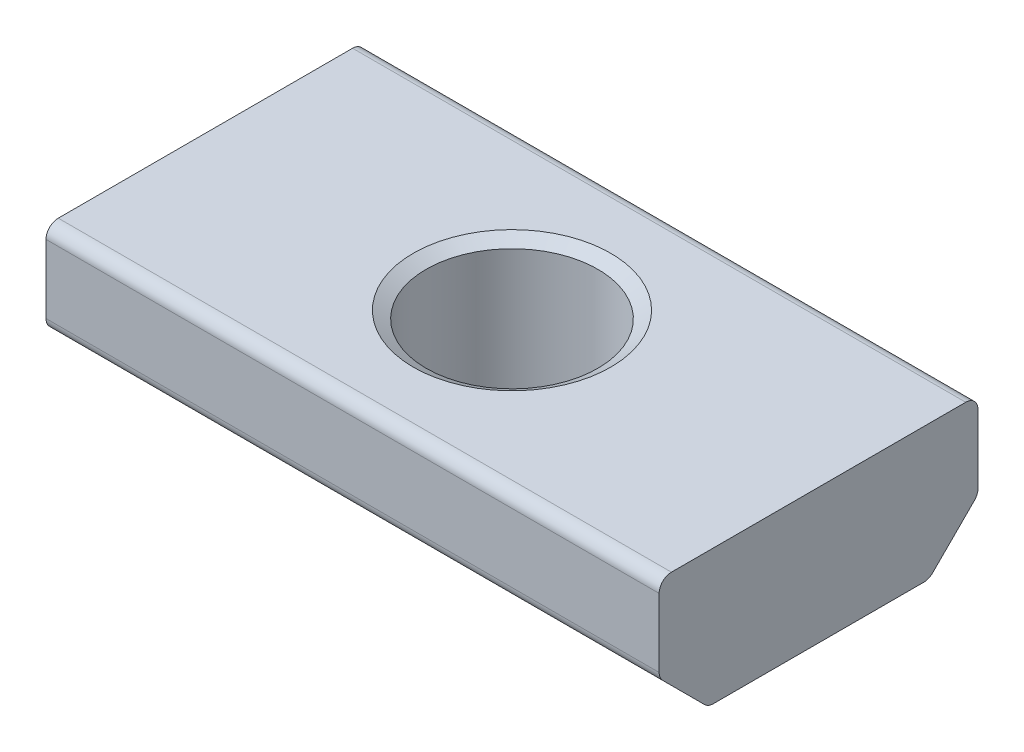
ISO-10303-21;
HEADER;
FILE_DESCRIPTION(('STEP AP214'),'2;1');
FILE_NAME('part.step','',(''),(''),'','','');
FILE_SCHEMA(('AUTOMOTIVE_DESIGN { 1 0 10303 214 1 1 1 1 }'));
ENDSEC;
DATA;
#1=APPLICATION_CONTEXT('core data for automotive mechanical design processes');
#2=APPLICATION_PROTOCOL_DEFINITION('international standard','automotive_design',2000,#1);
#3=PRODUCT_CONTEXT('',#1,'mechanical');
#4=PRODUCT('Part','Part','',(#3));
#5=PRODUCT_RELATED_PRODUCT_CATEGORY('part','',(#4));
#6=PRODUCT_DEFINITION_FORMATION('','',#4);
#7=PRODUCT_DEFINITION_CONTEXT('part definition',#1,'design');
#8=PRODUCT_DEFINITION('design','',#6,#7);
#9=PRODUCT_DEFINITION_SHAPE('','',#8);
#10=(LENGTH_UNIT() NAMED_UNIT(*) SI_UNIT(.MILLI.,.METRE.));
#11=(NAMED_UNIT(*) PLANE_ANGLE_UNIT() SI_UNIT($,.RADIAN.));
#12=(NAMED_UNIT(*) SI_UNIT($,.STERADIAN.) SOLID_ANGLE_UNIT());
#13=UNCERTAINTY_MEASURE_WITH_UNIT(LENGTH_MEASURE(1.E-05),#10,'distance_accuracy_value','');
#14=(GEOMETRIC_REPRESENTATION_CONTEXT(3) GLOBAL_UNCERTAINTY_ASSIGNED_CONTEXT((#13)) GLOBAL_UNIT_ASSIGNED_CONTEXT((#10,
#11,#12)) REPRESENTATION_CONTEXT('',''));
#15=CARTESIAN_POINT('',(0.,0.,0.));
#16=DIRECTION('',(0.,0.,1.));
#17=DIRECTION('',(1.,0.,0.));
#18=AXIS2_PLACEMENT_3D('',#15,#16,#17);
#19=CARTESIAN_POINT('',(0.,5.5,0.));
#20=DIRECTION('',(1.,0.,0.));
#21=DIRECTION('',(0.,0.,-1.));
#22=AXIS2_PLACEMENT_3D('',#19,#20,#21);
#23=PLANE('',#22);
#24=DIRECTION('',(0.,0.707106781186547,0.707106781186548));
#25=VECTOR('',#24,1.);
#26=CARTESIAN_POINT('',(0.,1.99999999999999,0.));
#27=LINE('',#26,#25);
#28=CARTESIAN_POINT('',(0.,0.146446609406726,-1.85355339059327));
#29=VERTEX_POINT('',#28);
#30=CARTESIAN_POINT('',(0.,1.85355339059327,-0.146446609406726));
#31=VERTEX_POINT('',#30);
#32=EDGE_CURVE('E153',#29,#31,#27,.T.);
#33=ORIENTED_EDGE('',*,*,#32,.T.);
#34=CARTESIAN_POINT('',(0.,2.20710678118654,-0.5));
#35=DIRECTION('',(1.,0.,0.));
#36=DIRECTION('',(0.,0.,-1.));
#37=AXIS2_PLACEMENT_3D('',#34,#35,#36);
#38=CIRCLE('',#37,0.5);
#39=CARTESIAN_POINT('',(0.,2.20710678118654,0.));
#40=VERTEX_POINT('',#39);
#41=EDGE_CURVE('E152',#31,#40,#38,.F.);
#42=ORIENTED_EDGE('',*,*,#41,.T.);
#43=DIRECTION('',(0.,-1.,0.));
#44=VECTOR('',#43,1.);
#45=CARTESIAN_POINT('',(0.,5.5,0.));
#46=LINE('',#45,#44);
#47=CARTESIAN_POINT('',(0.,5.,0.));
#48=VERTEX_POINT('',#47);
#49=EDGE_CURVE('E142',#48,#40,#46,.T.);
#50=ORIENTED_EDGE('',*,*,#49,.F.);
#51=CARTESIAN_POINT('',(0.,5.,-0.5));
#52=DIRECTION('',(1.,0.,0.));
#53=DIRECTION('',(0.,0.,-1.));
#54=AXIS2_PLACEMENT_3D('',#51,#52,#53);
#55=CIRCLE('',#54,0.5);
#56=CARTESIAN_POINT('',(0.,5.5,-0.5));
#57=VERTEX_POINT('',#56);
#58=EDGE_CURVE('E62',#48,#57,#55,.F.);
#59=ORIENTED_EDGE('',*,*,#58,.T.);
#60=DIRECTION('',(0.,0.,1.));
#61=VECTOR('',#60,1.);
#62=CARTESIAN_POINT('',(0.,5.5,0.));
#63=LINE('',#62,#61);
#64=CARTESIAN_POINT('',(0.,5.5,-12.5));
#65=VERTEX_POINT('',#64);
#66=EDGE_CURVE('E190',#65,#57,#63,.T.);
#67=ORIENTED_EDGE('',*,*,#66,.F.);
#68=CARTESIAN_POINT('',(0.,5.,-12.5));
#69=DIRECTION('',(1.,0.,0.));
#70=DIRECTION('',(0.,0.,-1.));
#71=AXIS2_PLACEMENT_3D('',#68,#69,#70);
#72=CIRCLE('',#71,0.5);
#73=CARTESIAN_POINT('',(0.,5.,-13.));
#74=VERTEX_POINT('',#73);
#75=EDGE_CURVE('E70',#65,#74,#72,.F.);
#76=ORIENTED_EDGE('',*,*,#75,.T.);
#77=DIRECTION('',(0.,-1.,0.));
#78=VECTOR('',#77,1.);
#79=CARTESIAN_POINT('',(0.,5.5,-13.));
#80=LINE('',#79,#78);
#81=CARTESIAN_POINT('',(0.,2.20710678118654,-13.));
#82=VERTEX_POINT('',#81);
#83=EDGE_CURVE('E197',#74,#82,#80,.T.);
#84=ORIENTED_EDGE('',*,*,#83,.T.);
#85=CARTESIAN_POINT('',(0.,2.20710678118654,-12.5));
#86=DIRECTION('',(1.,0.,0.));
#87=DIRECTION('',(0.,0.,-1.));
#88=AXIS2_PLACEMENT_3D('',#85,#86,#87);
#89=CIRCLE('',#88,0.5);
#90=CARTESIAN_POINT('',(0.,1.85355339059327,-12.8535533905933));
#91=VERTEX_POINT('',#90);
#92=EDGE_CURVE('E159',#82,#91,#89,.F.);
#93=ORIENTED_EDGE('',*,*,#92,.T.);
#94=DIRECTION('',(0.,-0.707106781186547,0.707106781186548));
#95=VECTOR('',#94,1.);
#96=CARTESIAN_POINT('',(0.,1.99999999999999,-13.));
#97=LINE('',#96,#95);
#98=CARTESIAN_POINT('',(0.,0.146446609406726,-11.1464466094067));
#99=VERTEX_POINT('',#98);
#100=EDGE_CURVE('E216',#91,#99,#97,.T.);
#101=ORIENTED_EDGE('',*,*,#100,.T.);
#102=CARTESIAN_POINT('',(0.,0.5,-10.7928932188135));
#103=DIRECTION('',(1.,0.,0.));
#104=DIRECTION('',(0.,0.,-1.));
#105=AXIS2_PLACEMENT_3D('',#102,#103,#104);
#106=CIRCLE('',#105,0.5);
#107=CARTESIAN_POINT('',(0.,0.,-10.7928932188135));
#108=VERTEX_POINT('',#107);
#109=EDGE_CURVE('E166',#99,#108,#106,.F.);
#110=ORIENTED_EDGE('',*,*,#109,.T.);
#111=DIRECTION('',(0.,0.,1.));
#112=VECTOR('',#111,1.);
#113=CARTESIAN_POINT('',(0.,0.,0.));
#114=LINE('',#113,#112);
#115=CARTESIAN_POINT('',(0.,0.,-2.20710678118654));
#116=VERTEX_POINT('',#115);
#117=EDGE_CURVE('E206',#108,#116,#114,.T.);
#118=ORIENTED_EDGE('',*,*,#117,.T.);
#119=CARTESIAN_POINT('',(0.,0.5,-2.20710678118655));
#120=DIRECTION('',(1.,0.,0.));
#121=DIRECTION('',(0.,0.,-1.));
#122=AXIS2_PLACEMENT_3D('',#119,#120,#121);
#123=CIRCLE('',#122,0.5);
#124=EDGE_CURVE('E168',#116,#29,#123,.F.);
#125=ORIENTED_EDGE('',*,*,#124,.T.);
#126=EDGE_LOOP('',(#33,#42,#50,#59,#67,#76,#84,#93,#101,#110,#118,#125));
#127=FACE_BOUND('',#126,.T.);
#128=ADVANCED_FACE('F47',(#127),#23,.F.);
#129=CARTESIAN_POINT('',(0.,5.5,0.));
#130=DIRECTION('',(0.,0.,-1.));
#131=DIRECTION('',(-1.,0.,0.));
#132=AXIS2_PLACEMENT_3D('',#129,#130,#131);
#133=PLANE('',#132);
#134=ORIENTED_EDGE('',*,*,#49,.T.);
#135=DIRECTION('',(1.,0.,0.));
#136=VECTOR('',#135,1.);
#137=CARTESIAN_POINT('',(25.,2.20710678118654,0.));
#138=LINE('',#137,#136);
#139=CARTESIAN_POINT('',(25.,2.20710678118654,0.));
#140=VERTEX_POINT('',#139);
#141=EDGE_CURVE('E147',#40,#140,#138,.T.);
#142=ORIENTED_EDGE('',*,*,#141,.T.);
#143=DIRECTION('',(0.,-1.,0.));
#144=VECTOR('',#143,1.);
#145=CARTESIAN_POINT('',(25.,5.5,0.));
#146=LINE('',#145,#144);
#147=CARTESIAN_POINT('',(25.,5.,0.));
#148=VERTEX_POINT('',#147);
#149=EDGE_CURVE('E145',#148,#140,#146,.T.);
#150=ORIENTED_EDGE('',*,*,#149,.F.);
#151=DIRECTION('',(1.,0.,0.));
#152=VECTOR('',#151,1.);
#153=CARTESIAN_POINT('',(0.,5.,0.));
#154=LINE('',#153,#152);
#155=EDGE_CURVE('E139',#148,#48,#154,.F.);
#156=ORIENTED_EDGE('',*,*,#155,.T.);
#157=EDGE_LOOP('',(#134,#142,#150,#156));
#158=FACE_BOUND('',#157,.T.);
#159=ADVANCED_FACE('F140',(#158),#133,.F.);
#160=CARTESIAN_POINT('',(25.,5.5,0.));
#161=DIRECTION('',(-1.,0.,0.));
#162=DIRECTION('',(0.,0.,1.));
#163=AXIS2_PLACEMENT_3D('',#160,#161,#162);
#164=PLANE('',#163);
#165=ORIENTED_EDGE('',*,*,#149,.T.);
#166=CARTESIAN_POINT('',(25.,2.20710678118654,-0.5));
#167=DIRECTION('',(-1.,0.,0.));
#168=DIRECTION('',(0.,0.,1.));
#169=AXIS2_PLACEMENT_3D('',#166,#167,#168);
#170=CIRCLE('',#169,0.5);
#171=CARTESIAN_POINT('',(25.,1.85355339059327,-0.146446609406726));
#172=VERTEX_POINT('',#171);
#173=EDGE_CURVE('E233',#140,#172,#170,.F.);
#174=ORIENTED_EDGE('',*,*,#173,.T.);
#175=DIRECTION('',(0.,-0.707106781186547,-0.707106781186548));
#176=VECTOR('',#175,1.);
#177=CARTESIAN_POINT('',(25.,1.99999999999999,0.));
#178=LINE('',#177,#176);
#179=CARTESIAN_POINT('',(25.,0.146446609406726,-1.85355339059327));
#180=VERTEX_POINT('',#179);
#181=EDGE_CURVE('E219',#172,#180,#178,.T.);
#182=ORIENTED_EDGE('',*,*,#181,.T.);
#183=CARTESIAN_POINT('',(25.,0.5,-2.20710678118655));
#184=DIRECTION('',(-1.,0.,0.));
#185=DIRECTION('',(0.,0.,1.));
#186=AXIS2_PLACEMENT_3D('',#183,#184,#185);
#187=CIRCLE('',#186,0.5);
#188=CARTESIAN_POINT('',(25.,0.,-2.20710678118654));
#189=VERTEX_POINT('',#188);
#190=EDGE_CURVE('E231',#180,#189,#187,.F.);
#191=ORIENTED_EDGE('',*,*,#190,.T.);
#192=DIRECTION('',(0.,0.,-1.));
#193=VECTOR('',#192,1.);
#194=CARTESIAN_POINT('',(25.,0.,0.));
#195=LINE('',#194,#193);
#196=CARTESIAN_POINT('',(25.,0.,-10.7928932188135));
#197=VERTEX_POINT('',#196);
#198=EDGE_CURVE('E202',#189,#197,#195,.T.);
#199=ORIENTED_EDGE('',*,*,#198,.T.);
#200=CARTESIAN_POINT('',(25.,0.5,-10.7928932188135));
#201=DIRECTION('',(-1.,0.,0.));
#202=DIRECTION('',(0.,0.,1.));
#203=AXIS2_PLACEMENT_3D('',#200,#201,#202);
#204=CIRCLE('',#203,0.5);
#205=CARTESIAN_POINT('',(25.,0.146446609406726,-11.1464466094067));
#206=VERTEX_POINT('',#205);
#207=EDGE_CURVE('E229',#197,#206,#204,.F.);
#208=ORIENTED_EDGE('',*,*,#207,.T.);
#209=DIRECTION('',(0.,0.707106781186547,-0.707106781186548));
#210=VECTOR('',#209,1.);
#211=CARTESIAN_POINT('',(25.,1.99999999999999,-13.));
#212=LINE('',#211,#210);
#213=CARTESIAN_POINT('',(25.,1.85355339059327,-12.8535533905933));
#214=VERTEX_POINT('',#213);
#215=EDGE_CURVE('E148',#206,#214,#212,.T.);
#216=ORIENTED_EDGE('',*,*,#215,.T.);
#217=CARTESIAN_POINT('',(25.,2.20710678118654,-12.5));
#218=DIRECTION('',(-1.,0.,0.));
#219=DIRECTION('',(0.,0.,1.));
#220=AXIS2_PLACEMENT_3D('',#217,#218,#219);
#221=CIRCLE('',#220,0.5);
#222=CARTESIAN_POINT('',(25.,2.20710678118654,-13.));
#223=VERTEX_POINT('',#222);
#224=EDGE_CURVE('E227',#214,#223,#221,.F.);
#225=ORIENTED_EDGE('',*,*,#224,.T.);
#226=DIRECTION('',(0.,-1.,0.));
#227=VECTOR('',#226,1.);
#228=CARTESIAN_POINT('',(25.,5.5,-13.));
#229=LINE('',#228,#227);
#230=CARTESIAN_POINT('',(25.,5.,-13.));
#231=VERTEX_POINT('',#230);
#232=EDGE_CURVE('E200',#231,#223,#229,.T.);
#233=ORIENTED_EDGE('',*,*,#232,.F.);
#234=CARTESIAN_POINT('',(25.,5.,-12.5));
#235=DIRECTION('',(-1.,0.,0.));
#236=DIRECTION('',(0.,0.,1.));
#237=AXIS2_PLACEMENT_3D('',#234,#235,#236);
#238=CIRCLE('',#237,0.5);
#239=CARTESIAN_POINT('',(25.,5.5,-12.5));
#240=VERTEX_POINT('',#239);
#241=EDGE_CURVE('E196',#231,#240,#238,.F.);
#242=ORIENTED_EDGE('',*,*,#241,.T.);
#243=DIRECTION('',(0.,0.,-1.));
#244=VECTOR('',#243,1.);
#245=CARTESIAN_POINT('',(25.,5.5,0.));
#246=LINE('',#245,#244);
#247=CARTESIAN_POINT('',(25.,5.5,-0.5));
#248=VERTEX_POINT('',#247);
#249=EDGE_CURVE('E189',#248,#240,#246,.T.);
#250=ORIENTED_EDGE('',*,*,#249,.F.);
#251=CARTESIAN_POINT('',(25.,5.,-0.5));
#252=DIRECTION('',(-1.,0.,0.));
#253=DIRECTION('',(0.,0.,1.));
#254=AXIS2_PLACEMENT_3D('',#251,#252,#253);
#255=CIRCLE('',#254,0.5);
#256=EDGE_CURVE('E193',#248,#148,#255,.F.);
#257=ORIENTED_EDGE('',*,*,#256,.T.);
#258=EDGE_LOOP('',(#165,#174,#182,#191,#199,#208,#216,#225,#233,#242,#250,#257));
#259=FACE_BOUND('',#258,.T.);
#260=ADVANCED_FACE('F192',(#259),#164,.F.);
#261=CARTESIAN_POINT('',(0.,5.5,-13.));
#262=DIRECTION('',(0.,0.,1.));
#263=DIRECTION('',(1.,0.,0.));
#264=AXIS2_PLACEMENT_3D('',#261,#262,#263);
#265=PLANE('',#264);
#266=ORIENTED_EDGE('',*,*,#232,.T.);
#267=DIRECTION('',(-1.,0.,0.));
#268=VECTOR('',#267,1.);
#269=CARTESIAN_POINT('',(0.,2.20710678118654,-13.));
#270=LINE('',#269,#268);
#271=EDGE_CURVE('E183',#223,#82,#270,.T.);
#272=ORIENTED_EDGE('',*,*,#271,.T.);
#273=ORIENTED_EDGE('',*,*,#83,.F.);
#274=DIRECTION('',(-1.,0.,0.));
#275=VECTOR('',#274,1.);
#276=CARTESIAN_POINT('',(0.,5.,-13.));
#277=LINE('',#276,#275);
#278=EDGE_CURVE('E181',#74,#231,#277,.F.);
#279=ORIENTED_EDGE('',*,*,#278,.T.);
#280=EDGE_LOOP('',(#266,#272,#273,#279));
#281=FACE_BOUND('',#280,.T.);
#282=ADVANCED_FACE('F263',(#281),#265,.F.);
#283=CARTESIAN_POINT('',(0.,5.5,0.));
#284=DIRECTION('',(0.,-1.,0.));
#285=DIRECTION('',(0.,0.,-1.));
#286=AXIS2_PLACEMENT_3D('',#283,#284,#285);
#287=PLANE('',#286);
#288=CARTESIAN_POINT('',(12.5,5.5,-6.5));
#289=DIRECTION('',(0.,1.,0.));
#290=DIRECTION('',(0.,0.,1.));
#291=AXIS2_PLACEMENT_3D('',#288,#289,#290);
#292=CIRCLE('',#291,4.025);
#293=CARTESIAN_POINT('',(12.5,5.5,-2.47499999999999));
#294=VERTEX_POINT('',#293);
#295=EDGE_CURVE('E416',#294,#294,#292,.T.);
#296=ORIENTED_EDGE('',*,*,#295,.F.);
#297=EDGE_LOOP('',(#296));
#298=FACE_BOUND('',#297,.T.);
#299=ORIENTED_EDGE('',*,*,#249,.T.);
#300=DIRECTION('',(-1.,0.,0.));
#301=VECTOR('',#300,1.);
#302=CARTESIAN_POINT('',(0.,5.5,-12.5));
#303=LINE('',#302,#301);
#304=EDGE_CURVE('E11',#240,#65,#303,.T.);
#305=ORIENTED_EDGE('',*,*,#304,.T.);
#306=ORIENTED_EDGE('',*,*,#66,.T.);
#307=DIRECTION('',(1.,0.,0.));
#308=VECTOR('',#307,1.);
#309=CARTESIAN_POINT('',(0.,5.5,-0.5));
#310=LINE('',#309,#308);
#311=EDGE_CURVE('E55',#57,#248,#310,.T.);
#312=ORIENTED_EDGE('',*,*,#311,.T.);
#313=EDGE_LOOP('',(#299,#305,#306,#312));
#314=FACE_BOUND('',#313,.T.);
#315=ADVANCED_FACE('F188',(#298,#314),#287,.F.);
#316=CARTESIAN_POINT('',(0.,0.,0.));
#317=DIRECTION('',(0.,-1.,0.));
#318=DIRECTION('',(0.,0.,-1.));
#319=AXIS2_PLACEMENT_3D('',#316,#317,#318);
#320=PLANE('',#319);
#321=CARTESIAN_POINT('',(12.5,0.,-6.5));
#322=DIRECTION('',(0.,1.,0.));
#323=DIRECTION('',(0.,0.,1.));
#324=AXIS2_PLACEMENT_3D('',#321,#322,#323);
#325=CIRCLE('',#324,3.49999999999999);
#326=CARTESIAN_POINT('',(12.5,0.,-3.00000000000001));
#327=VERTEX_POINT('',#326);
#328=EDGE_CURVE('E209',#327,#327,#325,.T.);
#329=ORIENTED_EDGE('',*,*,#328,.T.);
#330=EDGE_LOOP('',(#329));
#331=FACE_BOUND('',#330,.T.);
#332=ORIENTED_EDGE('',*,*,#198,.F.);
#333=DIRECTION('',(-1.,0.,0.));
#334=VECTOR('',#333,1.);
#335=CARTESIAN_POINT('',(0.,0.,-2.20710678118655));
#336=LINE('',#335,#334);
#337=EDGE_CURVE('E174',#189,#116,#336,.T.);
#338=ORIENTED_EDGE('',*,*,#337,.T.);
#339=ORIENTED_EDGE('',*,*,#117,.F.);
#340=DIRECTION('',(1.,0.,0.));
#341=VECTOR('',#340,1.);
#342=CARTESIAN_POINT('',(0.,0.,-10.7928932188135));
#343=LINE('',#342,#341);
#344=EDGE_CURVE('E171',#108,#197,#343,.T.);
#345=ORIENTED_EDGE('',*,*,#344,.T.);
#346=EDGE_LOOP('',(#332,#338,#339,#345));
#347=FACE_BOUND('',#346,.T.);
#348=ADVANCED_FACE('F247',(#331,#347),#320,.T.);
#349=CARTESIAN_POINT('',(0.,1.99999999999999,-13.));
#350=DIRECTION('',(0.,-0.707106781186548,-0.707106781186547));
#351=DIRECTION('',(1.,0.,0.));
#352=AXIS2_PLACEMENT_3D('',#349,#350,#351);
#353=PLANE('',#352);
#354=ORIENTED_EDGE('',*,*,#215,.F.);
#355=DIRECTION('',(1.,0.,0.));
#356=VECTOR('',#355,1.);
#357=CARTESIAN_POINT('',(0.,0.146446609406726,-11.1464466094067));
#358=LINE('',#357,#356);
#359=EDGE_CURVE('E179',#206,#99,#358,.F.);
#360=ORIENTED_EDGE('',*,*,#359,.T.);
#361=ORIENTED_EDGE('',*,*,#100,.F.);
#362=DIRECTION('',(-1.,0.,0.));
#363=VECTOR('',#362,1.);
#364=CARTESIAN_POINT('',(25.,1.85355339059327,-12.8535533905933));
#365=LINE('',#364,#363);
#366=EDGE_CURVE('E177',#91,#214,#365,.F.);
#367=ORIENTED_EDGE('',*,*,#366,.T.);
#368=EDGE_LOOP('',(#354,#360,#361,#367));
#369=FACE_BOUND('',#368,.T.);
#370=ADVANCED_FACE('F257',(#369),#353,.T.);
#371=CARTESIAN_POINT('',(0.,1.99999999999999,0.));
#372=DIRECTION('',(0.,-0.707106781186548,0.707106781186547));
#373=DIRECTION('',(-1.,0.,0.));
#374=AXIS2_PLACEMENT_3D('',#371,#372,#373);
#375=PLANE('',#374);
#376=ORIENTED_EDGE('',*,*,#181,.F.);
#377=DIRECTION('',(1.,0.,0.));
#378=VECTOR('',#377,1.);
#379=CARTESIAN_POINT('',(0.,1.85355339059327,-0.146446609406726));
#380=LINE('',#379,#378);
#381=EDGE_CURVE('E157',#172,#31,#380,.F.);
#382=ORIENTED_EDGE('',*,*,#381,.T.);
#383=ORIENTED_EDGE('',*,*,#32,.F.);
#384=DIRECTION('',(-1.,0.,0.));
#385=VECTOR('',#384,1.);
#386=CARTESIAN_POINT('',(0.,0.146446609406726,-1.85355339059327));
#387=LINE('',#386,#385);
#388=EDGE_CURVE('E161',#29,#180,#387,.F.);
#389=ORIENTED_EDGE('',*,*,#388,.T.);
#390=EDGE_LOOP('',(#376,#382,#383,#389));
#391=FACE_BOUND('',#390,.T.);
#392=ADVANCED_FACE('F238',(#391),#375,.T.);
#393=CARTESIAN_POINT('',(0.,2.20710678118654,-0.5));
#394=DIRECTION('',(-1.,0.,0.));
#395=DIRECTION('',(0.,0.,1.));
#396=AXIS2_PLACEMENT_3D('',#393,#394,#395);
#397=CYLINDRICAL_SURFACE('',#396,0.5);
#398=ORIENTED_EDGE('',*,*,#41,.F.);
#399=ORIENTED_EDGE('',*,*,#381,.F.);
#400=ORIENTED_EDGE('',*,*,#173,.F.);
#401=ORIENTED_EDGE('',*,*,#141,.F.);
#402=EDGE_LOOP('',(#398,#399,#400,#401));
#403=FACE_BOUND('',#402,.T.);
#404=ADVANCED_FACE('F285',(#403),#397,.T.);
#405=CARTESIAN_POINT('',(0.,0.5,-2.20710678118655));
#406=DIRECTION('',(-1.,0.,0.));
#407=DIRECTION('',(0.,0.,1.));
#408=AXIS2_PLACEMENT_3D('',#405,#406,#407);
#409=CYLINDRICAL_SURFACE('',#408,0.5);
#410=ORIENTED_EDGE('',*,*,#190,.F.);
#411=ORIENTED_EDGE('',*,*,#388,.F.);
#412=ORIENTED_EDGE('',*,*,#124,.F.);
#413=ORIENTED_EDGE('',*,*,#337,.F.);
#414=EDGE_LOOP('',(#410,#411,#412,#413));
#415=FACE_BOUND('',#414,.T.);
#416=ADVANCED_FACE('F244',(#415),#409,.T.);
#417=CARTESIAN_POINT('',(0.,0.5,-10.7928932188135));
#418=DIRECTION('',(1.,0.,0.));
#419=DIRECTION('',(0.,0.,-1.));
#420=AXIS2_PLACEMENT_3D('',#417,#418,#419);
#421=CYLINDRICAL_SURFACE('',#420,0.5);
#422=ORIENTED_EDGE('',*,*,#109,.F.);
#423=ORIENTED_EDGE('',*,*,#359,.F.);
#424=ORIENTED_EDGE('',*,*,#207,.F.);
#425=ORIENTED_EDGE('',*,*,#344,.F.);
#426=EDGE_LOOP('',(#422,#423,#424,#425));
#427=FACE_BOUND('',#426,.T.);
#428=ADVANCED_FACE('F253',(#427),#421,.T.);
#429=CARTESIAN_POINT('',(0.,2.20710678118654,-12.5));
#430=DIRECTION('',(1.,0.,0.));
#431=DIRECTION('',(0.,0.,-1.));
#432=AXIS2_PLACEMENT_3D('',#429,#430,#431);
#433=CYLINDRICAL_SURFACE('',#432,0.5);
#434=ORIENTED_EDGE('',*,*,#224,.F.);
#435=ORIENTED_EDGE('',*,*,#366,.F.);
#436=ORIENTED_EDGE('',*,*,#92,.F.);
#437=ORIENTED_EDGE('',*,*,#271,.F.);
#438=EDGE_LOOP('',(#434,#435,#436,#437));
#439=FACE_BOUND('',#438,.T.);
#440=ADVANCED_FACE('F260',(#439),#433,.T.);
#441=CARTESIAN_POINT('',(0.,5.,-12.5));
#442=DIRECTION('',(-1.,0.,0.));
#443=DIRECTION('',(0.,0.,1.));
#444=AXIS2_PLACEMENT_3D('',#441,#442,#443);
#445=CYLINDRICAL_SURFACE('',#444,0.5);
#446=ORIENTED_EDGE('',*,*,#241,.F.);
#447=ORIENTED_EDGE('',*,*,#278,.F.);
#448=ORIENTED_EDGE('',*,*,#75,.F.);
#449=ORIENTED_EDGE('',*,*,#304,.F.);
#450=EDGE_LOOP('',(#446,#447,#448,#449));
#451=FACE_BOUND('',#450,.T.);
#452=ADVANCED_FACE('F265',(#451),#445,.T.);
#453=CARTESIAN_POINT('',(0.,5.,-0.5));
#454=DIRECTION('',(1.,0.,0.));
#455=DIRECTION('',(0.,0.,-1.));
#456=AXIS2_PLACEMENT_3D('',#453,#454,#455);
#457=CYLINDRICAL_SURFACE('',#456,0.5);
#458=ORIENTED_EDGE('',*,*,#58,.F.);
#459=ORIENTED_EDGE('',*,*,#155,.F.);
#460=ORIENTED_EDGE('',*,*,#256,.F.);
#461=ORIENTED_EDGE('',*,*,#311,.F.);
#462=EDGE_LOOP('',(#458,#459,#460,#461));
#463=FACE_BOUND('',#462,.T.);
#464=ADVANCED_FACE('F49',(#463),#457,.T.);
#465=CARTESIAN_POINT('',(12.5,5.5,-6.5));
#466=DIRECTION('',(0.,1.,0.));
#467=DIRECTION('',(0.,0.,1.));
#468=AXIS2_PLACEMENT_3D('',#465,#466,#467);
#469=CYLINDRICAL_SURFACE('',#468,3.49999999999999);
#470=ORIENTED_EDGE('',*,*,#328,.F.);
#471=EDGE_LOOP('',(#470));
#472=FACE_BOUND('',#471,.T.);
#473=CARTESIAN_POINT('',(12.5,5.19689110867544,-6.5));
#474=DIRECTION('',(0.,1.,0.));
#475=DIRECTION('',(0.,0.,1.));
#476=AXIS2_PLACEMENT_3D('',#473,#474,#475);
#477=CIRCLE('',#476,3.5);
#478=CARTESIAN_POINT('',(12.5,5.19689110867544,-3.));
#479=VERTEX_POINT('',#478);
#480=EDGE_CURVE('E413',#479,#479,#477,.T.);
#481=ORIENTED_EDGE('',*,*,#480,.T.);
#482=EDGE_LOOP('',(#481));
#483=FACE_BOUND('',#482,.T.);
#484=ADVANCED_FACE('F271',(#472,#483),#469,.F.);
#485=CARTESIAN_POINT('',(12.5,5.5,-6.5));
#486=DIRECTION('',(0.,1.,0.));
#487=DIRECTION('',(0.,0.,1.));
#488=AXIS2_PLACEMENT_3D('',#485,#486,#487);
#489=CONICAL_SURFACE('',#488,4.025,1.0471975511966);
#490=ORIENTED_EDGE('',*,*,#480,.F.);
#491=EDGE_LOOP('',(#490));
#492=FACE_BOUND('',#491,.T.);
#493=ORIENTED_EDGE('',*,*,#295,.T.);
#494=EDGE_LOOP('',(#493));
#495=FACE_BOUND('',#494,.T.);
#496=ADVANCED_FACE('F342',(#492,#495),#489,.F.);
#497=CLOSED_SHELL('',(#128,#159,#260,#282,#315,#348,#370,#392,#404,#416,#428,#440,#452,#464,
#484,#496));
#498=MANIFOLD_SOLID_BREP('B2',#497);
#499=ADVANCED_BREP_SHAPE_REPRESENTATION('',(#18,#498),#14);
#500=SHAPE_DEFINITION_REPRESENTATION(#9,#499);
ENDSEC;
END-ISO-10303-21;
